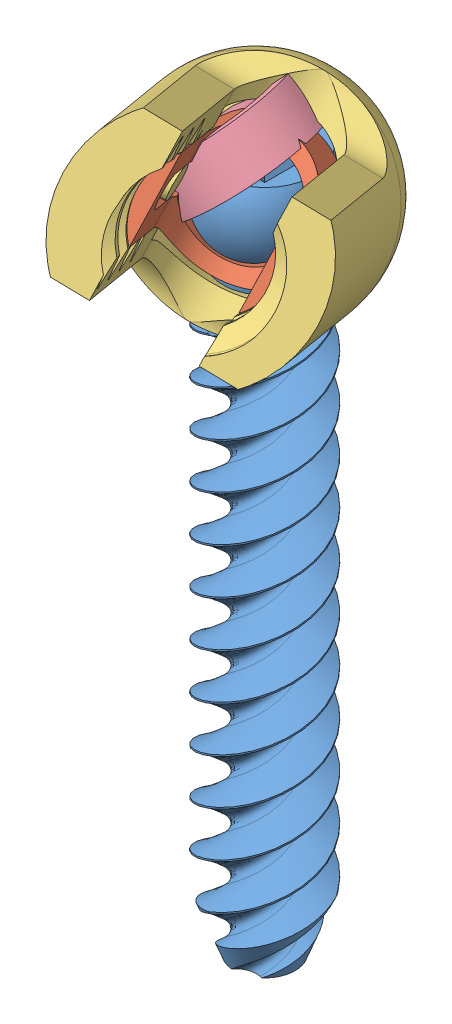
SolidWorks assembly PedicleScrew.SLDASM, configuration Default (file format 4700). Lengths in mm.
Overall size (21.91 58.69 24.77).
4 component instances, 4 part files, 6 mates.
Components (placement in the parent):
- SCrew-1: SCrew.SLDPRT [Default] at origin size (8 47.25 8)
- washer-1: washer.SLDPRT [Default] at (4.5219 10.437 8.1404) x (0.878837 -0.348492 -0.325881) z (-0.159273 -0.858115 0.488129) size (8 10.05 8)
- Head-1: Head.SLDPRT [Default] at (6.0961 11.7568 10.9742) x (-0.159273 -0.858115 0.488129) z (-0.878837 0.348492 0.325881) size (14.21 16.4 13.96)
- Circlip-2: Circlip.SLDPRT [Default] at (-0.8496 7.7008 0.2326) x (0.78597 0.606715 0.118945) z (0.01138 -0.206549 0.97837) size (9.5 3 9.06)
Mates (geometry in assembly coordinates):
- Coincident1: coordinate: point of SCrew-1; point of assembly
- Concentric2: concentric: sphere of SCrew-1; sphere of washer-1
- Concentric3: concentric anti-aligned: cylinder of washer-1 through (0.2493 6.8547 0.4487) axis (0.449752 0.377082 0.809649) radius 4; circle of Head-1
- Tangent2: tangent anti-aligned: plane of washer-1 through (-0.0522 10.2187 8.3128) normal (0.159273 0.858115 -0.488129); cylinder of Head-1 through (7.5477 7.0155 3.1127) axis (-0.878837 0.348492 0.325881) radius 1
- Concentric4: concentric: circle of Head-1; circle of Circlip-2
- Coincident7: coincident: plane of Head-1 through (0.341 4.0536 -0.2415) normal (-0.129858 0.987259 0.091962); plane of Circlip-2 through (0.341 4.0536 -0.2415) normal (0.129858 -0.987259 -0.091962)
